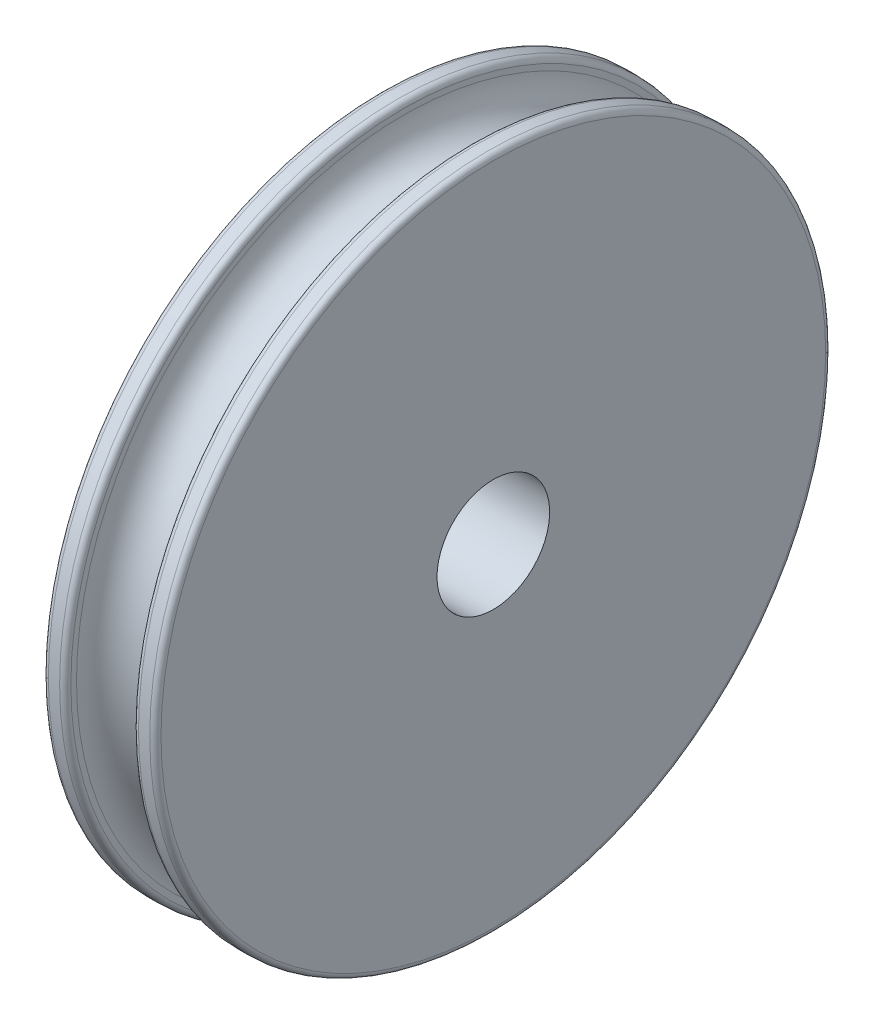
ISO-10303-21;
HEADER;
FILE_DESCRIPTION(('STEP AP214'),'2;1');
FILE_NAME('part.step','',(''),(''),'','','');
FILE_SCHEMA(('AUTOMOTIVE_DESIGN { 1 0 10303 214 1 1 1 1 }'));
ENDSEC;
DATA;
#1=APPLICATION_CONTEXT('core data for automotive mechanical design processes');
#2=APPLICATION_PROTOCOL_DEFINITION('international standard','automotive_design',2000,#1);
#3=PRODUCT_CONTEXT('',#1,'mechanical');
#4=PRODUCT('Part','Part','',(#3));
#5=PRODUCT_RELATED_PRODUCT_CATEGORY('part','',(#4));
#6=PRODUCT_DEFINITION_FORMATION('','',#4);
#7=PRODUCT_DEFINITION_CONTEXT('part definition',#1,'design');
#8=PRODUCT_DEFINITION('design','',#6,#7);
#9=PRODUCT_DEFINITION_SHAPE('','',#8);
#10=(LENGTH_UNIT() NAMED_UNIT(*) SI_UNIT(.MILLI.,.METRE.));
#11=(NAMED_UNIT(*) PLANE_ANGLE_UNIT() SI_UNIT($,.RADIAN.));
#12=(NAMED_UNIT(*) SI_UNIT($,.STERADIAN.) SOLID_ANGLE_UNIT());
#13=UNCERTAINTY_MEASURE_WITH_UNIT(LENGTH_MEASURE(1.E-05),#10,'distance_accuracy_value','');
#14=(GEOMETRIC_REPRESENTATION_CONTEXT(3) GLOBAL_UNCERTAINTY_ASSIGNED_CONTEXT((#13)) GLOBAL_UNIT_ASSIGNED_CONTEXT((#10,
#11,#12)) REPRESENTATION_CONTEXT('',''));
#15=CARTESIAN_POINT('',(0.,0.,0.));
#16=DIRECTION('',(0.,0.,1.));
#17=DIRECTION('',(1.,0.,0.));
#18=AXIS2_PLACEMENT_3D('',#15,#16,#17);
#19=CARTESIAN_POINT('',(5.,0.,0.));
#20=DIRECTION('',(-1.,0.,0.));
#21=DIRECTION('',(0.,0.,1.));
#22=AXIS2_PLACEMENT_3D('',#19,#20,#21);
#23=PLANE('',#22);
#24=CARTESIAN_POINT('',(5.,0.,0.));
#25=DIRECTION('',(-1.,0.,0.));
#26=DIRECTION('',(0.,0.,1.));
#27=AXIS2_PLACEMENT_3D('',#24,#25,#26);
#28=CIRCLE('',#27,5.);
#29=CARTESIAN_POINT('',(5.,0.,5.));
#30=VERTEX_POINT('',#29);
#31=EDGE_CURVE('E79',#30,#30,#28,.T.);
#32=ORIENTED_EDGE('',*,*,#31,.T.);
#33=EDGE_LOOP('',(#32));
#34=FACE_BOUND('',#33,.T.);
#35=CARTESIAN_POINT('',(5.,0.,0.));
#36=DIRECTION('',(-1.,0.,0.));
#37=DIRECTION('',(0.,0.,1.));
#38=AXIS2_PLACEMENT_3D('',#35,#36,#37);
#39=CIRCLE('',#38,29.5);
#40=CARTESIAN_POINT('',(5.,0.,29.5));
#41=VERTEX_POINT('',#40);
#42=EDGE_CURVE('E45',#41,#41,#39,.T.);
#43=ORIENTED_EDGE('',*,*,#42,.F.);
#44=EDGE_LOOP('',(#43));
#45=FACE_BOUND('',#44,.T.);
#46=ADVANCED_FACE('F39',(#34,#45),#23,.F.);
#47=CARTESIAN_POINT('',(4.5,0.,0.));
#48=DIRECTION('',(-1.,0.,0.));
#49=DIRECTION('',(0.,0.,1.));
#50=AXIS2_PLACEMENT_3D('',#47,#48,#49);
#51=TOROIDAL_SURFACE('',#50,29.5,0.5);
#52=CARTESIAN_POINT('',(4.5,0.,0.));
#53=DIRECTION('',(-1.,0.,0.));
#54=DIRECTION('',(0.,0.,1.));
#55=AXIS2_PLACEMENT_3D('',#52,#53,#54);
#56=CIRCLE('',#55,30.);
#57=CARTESIAN_POINT('',(4.5,0.,30.));
#58=VERTEX_POINT('',#57);
#59=EDGE_CURVE('E49',#58,#58,#56,.T.);
#60=ORIENTED_EDGE('',*,*,#59,.F.);
#61=EDGE_LOOP('',(#60));
#62=FACE_BOUND('',#61,.T.);
#63=ORIENTED_EDGE('',*,*,#42,.T.);
#64=EDGE_LOOP('',(#63));
#65=FACE_BOUND('',#64,.T.);
#66=ADVANCED_FACE('F104',(#62,#65),#51,.T.);
#67=CARTESIAN_POINT('',(-15.1556723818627,0.,0.));
#68=DIRECTION('',(-1.,0.,0.));
#69=DIRECTION('',(0.,0.,1.));
#70=AXIS2_PLACEMENT_3D('',#67,#68,#69);
#71=CYLINDRICAL_SURFACE('',#70,30.);
#72=CARTESIAN_POINT('',(3.5,0.,0.));
#73=DIRECTION('',(-1.,0.,0.));
#74=DIRECTION('',(0.,0.,1.));
#75=AXIS2_PLACEMENT_3D('',#72,#73,#74);
#76=CIRCLE('',#75,30.);
#77=CARTESIAN_POINT('',(3.5,0.,30.));
#78=VERTEX_POINT('',#77);
#79=EDGE_CURVE('E53',#78,#78,#76,.T.);
#80=ORIENTED_EDGE('',*,*,#79,.F.);
#81=EDGE_LOOP('',(#80));
#82=FACE_BOUND('',#81,.T.);
#83=ORIENTED_EDGE('',*,*,#59,.T.);
#84=EDGE_LOOP('',(#83));
#85=FACE_BOUND('',#84,.T.);
#86=ADVANCED_FACE('F109',(#82,#85),#71,.T.);
#87=CARTESIAN_POINT('',(3.5,0.,0.));
#88=DIRECTION('',(-1.,0.,0.));
#89=DIRECTION('',(0.,0.,1.));
#90=AXIS2_PLACEMENT_3D('',#87,#88,#89);
#91=TOROIDAL_SURFACE('',#90,29.5,0.5);
#92=CARTESIAN_POINT('',(3.,0.,0.));
#93=DIRECTION('',(-1.,0.,0.));
#94=DIRECTION('',(0.,0.,1.));
#95=AXIS2_PLACEMENT_3D('',#92,#93,#94);
#96=CIRCLE('',#95,29.5);
#97=CARTESIAN_POINT('',(3.,0.,29.5));
#98=VERTEX_POINT('',#97);
#99=EDGE_CURVE('E58',#98,#98,#96,.T.);
#100=ORIENTED_EDGE('',*,*,#99,.F.);
#101=EDGE_LOOP('',(#100));
#102=FACE_BOUND('',#101,.T.);
#103=ORIENTED_EDGE('',*,*,#79,.T.);
#104=EDGE_LOOP('',(#103));
#105=FACE_BOUND('',#104,.T.);
#106=ADVANCED_FACE('F155',(#102,#105),#91,.T.);
#107=CARTESIAN_POINT('',(3.,29.,0.));
#108=DIRECTION('',(1.,0.,0.));
#109=DIRECTION('',(0.,0.,-1.));
#110=AXIS2_PLACEMENT_3D('',#107,#108,#109);
#111=PLANE('',#110);
#112=CARTESIAN_POINT('',(3.,0.,0.));
#113=DIRECTION('',(-1.,0.,0.));
#114=DIRECTION('',(0.,0.,1.));
#115=AXIS2_PLACEMENT_3D('',#112,#113,#114);
#116=CIRCLE('',#115,29.);
#117=CARTESIAN_POINT('',(3.,0.,29.));
#118=VERTEX_POINT('',#117);
#119=EDGE_CURVE('E61',#118,#118,#116,.T.);
#120=ORIENTED_EDGE('',*,*,#119,.F.);
#121=EDGE_LOOP('',(#120));
#122=FACE_BOUND('',#121,.T.);
#123=ORIENTED_EDGE('',*,*,#99,.T.);
#124=EDGE_LOOP('',(#123));
#125=FACE_BOUND('',#124,.T.);
#126=ADVANCED_FACE('F149',(#122,#125),#111,.F.);
#127=CARTESIAN_POINT('',(0.,0.,0.));
#128=DIRECTION('',(-1.,0.,0.));
#129=DIRECTION('',(0.,0.,1.));
#130=AXIS2_PLACEMENT_3D('',#127,#128,#129);
#131=TOROIDAL_SURFACE('',#130,29.,3.);
#132=CARTESIAN_POINT('',(-3.,0.,0.));
#133=DIRECTION('',(-1.,0.,0.));
#134=DIRECTION('',(0.,0.,1.));
#135=AXIS2_PLACEMENT_3D('',#132,#133,#134);
#136=CIRCLE('',#135,29.);
#137=CARTESIAN_POINT('',(-3.,0.,29.));
#138=VERTEX_POINT('',#137);
#139=EDGE_CURVE('E64',#138,#138,#136,.T.);
#140=ORIENTED_EDGE('',*,*,#139,.F.);
#141=EDGE_LOOP('',(#140));
#142=FACE_BOUND('',#141,.T.);
#143=ORIENTED_EDGE('',*,*,#119,.T.);
#144=EDGE_LOOP('',(#143));
#145=FACE_BOUND('',#144,.T.);
#146=ADVANCED_FACE('F143',(#142,#145),#131,.F.);
#147=CARTESIAN_POINT('',(-3.,29.,0.));
#148=DIRECTION('',(-1.,0.,0.));
#149=DIRECTION('',(0.,0.,1.));
#150=AXIS2_PLACEMENT_3D('',#147,#148,#149);
#151=PLANE('',#150);
#152=CARTESIAN_POINT('',(-3.,0.,0.));
#153=DIRECTION('',(-1.,0.,0.));
#154=DIRECTION('',(0.,0.,1.));
#155=AXIS2_PLACEMENT_3D('',#152,#153,#154);
#156=CIRCLE('',#155,29.5);
#157=CARTESIAN_POINT('',(-3.,0.,29.5));
#158=VERTEX_POINT('',#157);
#159=EDGE_CURVE('E67',#158,#158,#156,.T.);
#160=ORIENTED_EDGE('',*,*,#159,.F.);
#161=EDGE_LOOP('',(#160));
#162=FACE_BOUND('',#161,.T.);
#163=ORIENTED_EDGE('',*,*,#139,.T.);
#164=EDGE_LOOP('',(#163));
#165=FACE_BOUND('',#164,.T.);
#166=ADVANCED_FACE('F137',(#162,#165),#151,.F.);
#167=CARTESIAN_POINT('',(-3.5,0.,0.));
#168=DIRECTION('',(-1.,0.,0.));
#169=DIRECTION('',(0.,0.,1.));
#170=AXIS2_PLACEMENT_3D('',#167,#168,#169);
#171=TOROIDAL_SURFACE('',#170,29.5,0.5);
#172=CARTESIAN_POINT('',(-3.5,0.,0.));
#173=DIRECTION('',(-1.,0.,0.));
#174=DIRECTION('',(0.,0.,1.));
#175=AXIS2_PLACEMENT_3D('',#172,#173,#174);
#176=CIRCLE('',#175,30.);
#177=CARTESIAN_POINT('',(-3.5,0.,30.));
#178=VERTEX_POINT('',#177);
#179=EDGE_CURVE('E70',#178,#178,#176,.T.);
#180=ORIENTED_EDGE('',*,*,#179,.F.);
#181=EDGE_LOOP('',(#180));
#182=FACE_BOUND('',#181,.T.);
#183=ORIENTED_EDGE('',*,*,#159,.T.);
#184=EDGE_LOOP('',(#183));
#185=FACE_BOUND('',#184,.T.);
#186=ADVANCED_FACE('F131',(#182,#185),#171,.T.);
#187=CARTESIAN_POINT('',(-15.1556723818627,0.,0.));
#188=DIRECTION('',(-1.,0.,0.));
#189=DIRECTION('',(0.,0.,1.));
#190=AXIS2_PLACEMENT_3D('',#187,#188,#189);
#191=CYLINDRICAL_SURFACE('',#190,30.);
#192=CARTESIAN_POINT('',(-4.5,0.,0.));
#193=DIRECTION('',(-1.,0.,0.));
#194=DIRECTION('',(0.,0.,1.));
#195=AXIS2_PLACEMENT_3D('',#192,#193,#194);
#196=CIRCLE('',#195,30.);
#197=CARTESIAN_POINT('',(-4.5,0.,30.));
#198=VERTEX_POINT('',#197);
#199=EDGE_CURVE('E73',#198,#198,#196,.T.);
#200=ORIENTED_EDGE('',*,*,#199,.F.);
#201=EDGE_LOOP('',(#200));
#202=FACE_BOUND('',#201,.T.);
#203=ORIENTED_EDGE('',*,*,#179,.T.);
#204=EDGE_LOOP('',(#203));
#205=FACE_BOUND('',#204,.T.);
#206=ADVANCED_FACE('F125',(#202,#205),#191,.T.);
#207=CARTESIAN_POINT('',(-4.5,0.,0.));
#208=DIRECTION('',(-1.,0.,0.));
#209=DIRECTION('',(0.,0.,1.));
#210=AXIS2_PLACEMENT_3D('',#207,#208,#209);
#211=TOROIDAL_SURFACE('',#210,29.5,0.5);
#212=CARTESIAN_POINT('',(-5.,0.,0.));
#213=DIRECTION('',(-1.,0.,0.));
#214=DIRECTION('',(0.,0.,1.));
#215=AXIS2_PLACEMENT_3D('',#212,#213,#214);
#216=CIRCLE('',#215,29.5);
#217=CARTESIAN_POINT('',(-5.,0.,29.5));
#218=VERTEX_POINT('',#217);
#219=EDGE_CURVE('E76',#218,#218,#216,.T.);
#220=ORIENTED_EDGE('',*,*,#219,.F.);
#221=EDGE_LOOP('',(#220));
#222=FACE_BOUND('',#221,.T.);
#223=ORIENTED_EDGE('',*,*,#199,.T.);
#224=EDGE_LOOP('',(#223));
#225=FACE_BOUND('',#224,.T.);
#226=ADVANCED_FACE('F118',(#222,#225),#211,.T.);
#227=CARTESIAN_POINT('',(-5.,0.,0.));
#228=DIRECTION('',(1.,0.,0.));
#229=DIRECTION('',(0.,0.,-1.));
#230=AXIS2_PLACEMENT_3D('',#227,#228,#229);
#231=PLANE('',#230);
#232=CARTESIAN_POINT('',(-5.,20.,0.));
#233=DIRECTION('',(1.,0.,0.));
#234=DIRECTION('',(0.,0.,-1.));
#235=AXIS2_PLACEMENT_3D('',#232,#233,#234);
#236=CIRCLE('',#235,2.);
#237=CARTESIAN_POINT('',(-5.,20.,-2.));
#238=VERTEX_POINT('',#237);
#239=EDGE_CURVE('E11',#238,#238,#236,.F.);
#240=ORIENTED_EDGE('',*,*,#239,.F.);
#241=EDGE_LOOP('',(#240));
#242=FACE_BOUND('',#241,.T.);
#243=CARTESIAN_POINT('',(-5.,0.,0.));
#244=DIRECTION('',(-1.,0.,0.));
#245=DIRECTION('',(0.,0.,1.));
#246=AXIS2_PLACEMENT_3D('',#243,#244,#245);
#247=CIRCLE('',#246,5.);
#248=CARTESIAN_POINT('',(-5.,0.,5.));
#249=VERTEX_POINT('',#248);
#250=EDGE_CURVE('E80',#249,#249,#247,.T.);
#251=ORIENTED_EDGE('',*,*,#250,.F.);
#252=EDGE_LOOP('',(#251));
#253=FACE_BOUND('',#252,.T.);
#254=ORIENTED_EDGE('',*,*,#219,.T.);
#255=EDGE_LOOP('',(#254));
#256=FACE_BOUND('',#255,.T.);
#257=ADVANCED_FACE('F100',(#242,#253,#256),#231,.F.);
#258=CARTESIAN_POINT('',(5.,0.,0.));
#259=DIRECTION('',(-1.,0.,0.));
#260=DIRECTION('',(0.,0.,1.));
#261=AXIS2_PLACEMENT_3D('',#258,#259,#260);
#262=CYLINDRICAL_SURFACE('',#261,5.);
#263=ORIENTED_EDGE('',*,*,#31,.F.);
#264=EDGE_LOOP('',(#263));
#265=FACE_BOUND('',#264,.T.);
#266=ORIENTED_EDGE('',*,*,#250,.T.);
#267=EDGE_LOOP('',(#266));
#268=FACE_BOUND('',#267,.T.);
#269=ADVANCED_FACE('F93',(#265,#268),#262,.F.);
#270=CARTESIAN_POINT('',(-7.,20.,0.));
#271=DIRECTION('',(1.,0.,0.));
#272=DIRECTION('',(0.,0.,-1.));
#273=AXIS2_PLACEMENT_3D('',#270,#271,#272);
#274=CYLINDRICAL_SURFACE('',#273,2.);
#275=CARTESIAN_POINT('',(-7.,20.,0.));
#276=DIRECTION('',(-1.,0.,0.));
#277=DIRECTION('',(0.,0.,1.));
#278=AXIS2_PLACEMENT_3D('',#275,#276,#277);
#279=CIRCLE('',#278,2.);
#280=CARTESIAN_POINT('',(-7.,20.,2.));
#281=VERTEX_POINT('',#280);
#282=EDGE_CURVE('E83',#281,#281,#279,.T.);
#283=ORIENTED_EDGE('',*,*,#282,.F.);
#284=EDGE_LOOP('',(#283));
#285=FACE_BOUND('',#284,.T.);
#286=ORIENTED_EDGE('',*,*,#239,.T.);
#287=EDGE_LOOP('',(#286));
#288=FACE_BOUND('',#287,.T.);
#289=ADVANCED_FACE('F91',(#285,#288),#274,.T.);
#290=CARTESIAN_POINT('',(-7.,20.,0.));
#291=DIRECTION('',(-1.,0.,0.));
#292=DIRECTION('',(0.,0.,1.));
#293=AXIS2_PLACEMENT_3D('',#290,#291,#292);
#294=PLANE('',#293);
#295=ORIENTED_EDGE('',*,*,#282,.T.);
#296=EDGE_LOOP('',(#295));
#297=FACE_BOUND('',#296,.T.);
#298=ADVANCED_FACE('F89',(#297),#294,.T.);
#299=CLOSED_SHELL('',(#46,#66,#86,#106,#126,#146,#166,#186,#206,#226,#257,#269,#289,#298));
#300=MANIFOLD_SOLID_BREP('B2',#299);
#301=ADVANCED_BREP_SHAPE_REPRESENTATION('',(#18,#300),#14);
#302=SHAPE_DEFINITION_REPRESENTATION(#9,#301);
ENDSEC;
END-ISO-10303-21;
